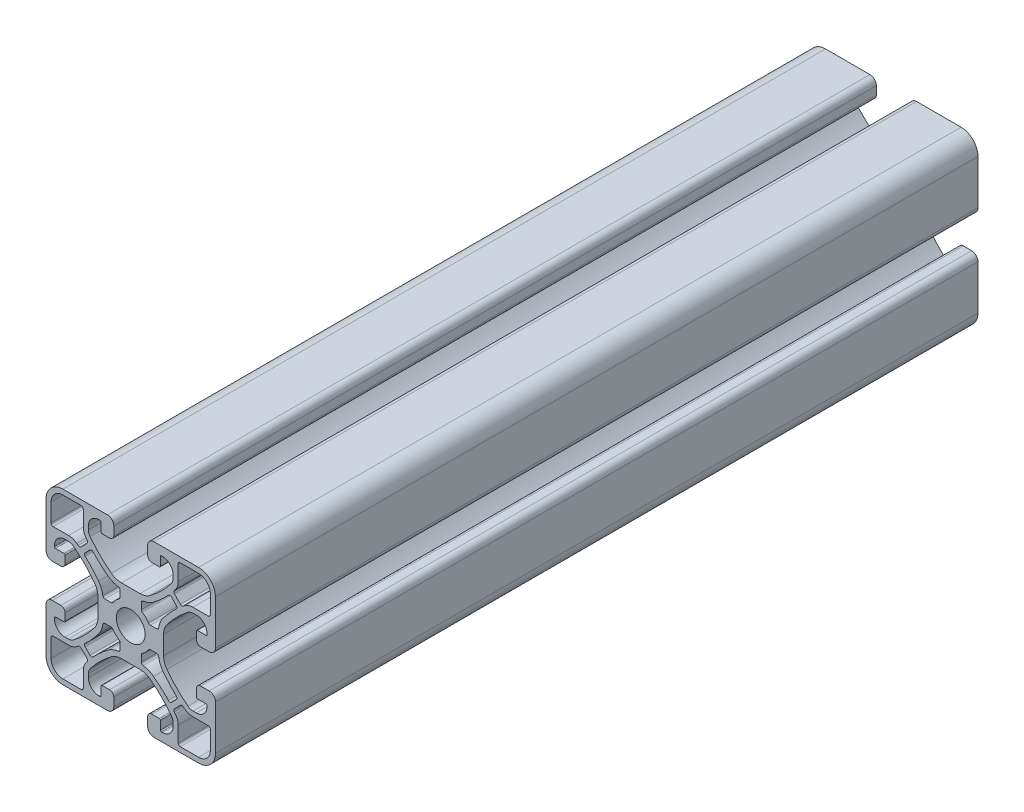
from build123d import *

# Parameters (mm, degrees)
ESQUISSE_PROFIL_R = 3.400000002
EXTRUSION1_DEPTH  = 180


with BuildPart() as part:
    # Esquisse profil → Extrusion1 (new body)
    with BuildSketch(Plane.XY):
        with BuildLine():
            Line((5.500000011, -20), (15.999999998, -20))
            ThreePointArc((15.999999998, -20), (18.82842711, -18.82842713), (20, -16.000000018))
            Line((20, -16.000000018), (20, -5.500000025))
            ThreePointArc((20, -5.500000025), (19.560660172, -4.439339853), (18.5, -4.000000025))
            Line((18.5, -4.000000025), (16.5, -4.000000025))
            ThreePointArc((16.5, -4.000000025), (15.792893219, -4.292893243), (15.5, -5.000000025))
            Line((15.5, -5.000000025), (15.5, -6.750000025))
            ThreePointArc((15.5, -6.750000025), (15.573223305, -6.92677672), (15.75, -7.000000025))
            Line((15.75, -7.000000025), (17.75, -7.000000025))
            ThreePointArc((17.75, -7.000000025), (17.926776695, -7.073223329), (18, -7.250000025))
            Line((18, -7.250000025), (18, -7.500000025))
            ThreePointArc((18, -7.500000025), (17.267766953, -9.267766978), (15.5, -10.000000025))
            Line((15.5, -10.000000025), (14.72036024, -10.000000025))
            ThreePointArc((14.72036024, -10.000000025), (14.083793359, -9.895991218), (13.51343504, -9.594782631))
            ThreePointArc((13.51343504, -9.594782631), (10.848996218, -7.2640298), (8.540476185, -4.580305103))
            ThreePointArc((8.540476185, -4.580305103), (7.952757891, -3.450415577), (7.75, -2.193056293))
            Line((7.75, -2.193056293), (7.75, 2.193056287))
            ThreePointArc((7.75, 2.193056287), (7.952757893, 3.450415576), (8.54047619, 4.580305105))
            ThreePointArc((8.54047619, 4.580305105), (10.848996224, 7.264029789), (13.513435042, 9.594782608))
            ThreePointArc((13.513435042, 9.594782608), (14.083793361, 9.895991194), (14.72036024, 10))
            Line((14.72036024, 10), (15.5, 10))
            ThreePointArc((15.5, 10), (17.267766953, 9.267766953), (18, 7.5))
            Line((18, 7.5), (18, 7.25))
            ThreePointArc((18, 7.25), (17.926776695, 7.073223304), (17.75, 7))
            Line((17.75, 7), (15.75, 7))
            ThreePointArc((15.75, 7), (15.573223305, 6.926776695), (15.5, 6.75))
            Line((15.5, 6.75), (15.5, 5))
            ThreePointArc((15.5, 5), (15.792893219, 4.292893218), (16.5, 4))
            Line((16.5, 4), (18.5, 4))
            ThreePointArc((18.5, 4), (19.560660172, 4.439339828), (20, 5.5))
            Line((20, 5.5), (20, 16.000000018))
            ThreePointArc((20, 16.000000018), (18.828427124, 18.828427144), (15.999999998, 20))
            Line((15.999999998, 20), (5.500000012, 20))
            ThreePointArc((5.500000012, 20), (4.43933984, 19.560660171), (4.000000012, 18.5))
            Line((4.000000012, 18.5), (4.000000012, 16.5))
            ThreePointArc((4.000000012, 16.5), (4.292893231, 15.792893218), (5.000000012, 15.5))
            Line((5.000000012, 15.5), (6.750000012, 15.5))
            ThreePointArc((6.750000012, 15.5), (6.926776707, 15.573223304), (7.000000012, 15.75))
            Line((7.000000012, 15.75), (7.000000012, 17.75))
            ThreePointArc((7.000000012, 17.75), (7.073223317, 17.926776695), (7.250000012, 18))
            Line((7.250000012, 18), (7.500000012, 18))
            ThreePointArc((7.500000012, 18), (9.267766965, 17.267766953), (10.000000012, 15.5))
            Line((10.000000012, 15.5), (10.000000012, 14.72036024))
            ThreePointArc((10.000000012, 14.72036024), (9.895991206, 14.083793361), (9.594782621, 13.513435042))
            ThreePointArc((9.594782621, 13.513435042), (7.264029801, 10.848996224), (4.580305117, 8.540476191))
            ThreePointArc((4.580305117, 8.540476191), (3.450415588, 7.952757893), (2.193056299, 7.75))
            Line((2.193056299, 7.75), (-2.193056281, 7.75))
            ThreePointArc((-2.193056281, 7.75), (-3.45041557, 7.952757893), (-4.580305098, 8.54047619))
            ThreePointArc((-4.580305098, 8.54047619), (-7.264029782, 10.848996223), (-9.594782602, 13.513435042))
            ThreePointArc((-9.594782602, 13.513435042), (-9.895991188, 14.08379336), (-9.999999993, 14.72036024))
            Line((-9.999999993, 14.72036024), (-9.999999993, 15.5))
            ThreePointArc((-9.999999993, 15.5), (-9.267766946, 17.267766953), (-7.499999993, 18))
            Line((-7.499999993, 18), (-7.249999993, 18))
            ThreePointArc((-7.249999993, 18), (-7.073223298, 17.926776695), (-6.999999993, 17.75))
            Line((-6.999999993, 17.75), (-6.999999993, 15.75))
            ThreePointArc((-6.999999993, 15.75), (-6.926776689, 15.573223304), (-6.749999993, 15.5))
            Line((-6.749999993, 15.5), (-4.999999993, 15.5))
            ThreePointArc((-4.999999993, 15.5), (-4.292893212, 15.792893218), (-3.999999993, 16.5))
            Line((-3.999999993, 16.5), (-3.999999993, 18.5))
            ThreePointArc((-3.999999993, 18.5), (-4.439339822, 19.560660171), (-5.499999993, 20))
            Line((-5.499999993, 20), (-15.999999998, 20))
            ThreePointArc((-15.999999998, 20), (-18.82842711, 18.82842713), (-20, 16.000000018))
            Line((-20, 16.000000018), (-20, 5.499999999))
            ThreePointArc((-20, 5.499999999), (-19.560660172, 4.439339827), (-18.5, 3.999999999))
            Line((-18.5, 3.999999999), (-16.5, 3.999999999))
            ThreePointArc((-16.5, 3.999999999), (-15.792893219, 4.292893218), (-15.5, 4.999999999))
            Line((-15.5, 4.999999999), (-15.5, 6.749999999))
            ThreePointArc((-15.5, 6.749999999), (-15.573223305, 6.926776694), (-15.75, 6.999999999))
            Line((-15.75, 6.999999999), (-17.75, 6.999999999))
            ThreePointArc((-17.75, 6.999999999), (-17.926776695, 7.073223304), (-18, 7.249999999))
            Line((-18, 7.249999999), (-18, 7.499999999))
            ThreePointArc((-18, 7.499999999), (-17.267766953, 9.267766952), (-15.5, 9.999999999))
            Line((-15.5, 9.999999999), (-14.72036024, 9.999999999))
            ThreePointArc((-14.72036024, 9.999999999), (-14.083793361, 9.895991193), (-13.513435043, 9.594782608))
            ThreePointArc((-13.513435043, 9.594782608), (-10.848996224, 7.264029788), (-8.540476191, 4.580305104))
            ThreePointArc((-8.540476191, 4.580305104), (-7.952757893, 3.450415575), (-7.75, 2.193056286))
            Line((-7.75, 2.193056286), (-7.75, -2.193056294))
            ThreePointArc((-7.75, -2.193056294), (-7.952757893, -3.450415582), (-8.54047619, -4.580305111))
            ThreePointArc((-8.54047619, -4.580305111), (-10.848996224, -7.264029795), (-13.513435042, -9.594782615))
            ThreePointArc((-13.513435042, -9.594782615), (-14.083793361, -9.8959912), (-14.72036024, -10.000000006))
            Line((-14.72036024, -10.000000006), (-15.5, -10.000000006))
            ThreePointArc((-15.5, -10.000000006), (-17.267766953, -9.267766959), (-18, -7.500000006))
            Line((-18, -7.500000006), (-18, -7.250000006))
            ThreePointArc((-18, -7.250000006), (-17.926776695, -7.073223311), (-17.75, -7.000000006))
            Line((-17.75, -7.000000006), (-15.75, -7.000000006))
            ThreePointArc((-15.75, -7.000000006), (-15.573223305, -6.926776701), (-15.5, -6.750000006))
            Line((-15.5, -6.750000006), (-15.5, -5.000000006))
            ThreePointArc((-15.5, -5.000000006), (-15.792893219, -4.292893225), (-16.5, -4.000000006))
            Line((-16.5, -4.000000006), (-18.5, -4.000000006))
            ThreePointArc((-18.5, -4.000000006), (-19.560660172, -4.439339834), (-20, -5.500000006))
            Line((-20, -5.500000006), (-20, -15.999999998))
            ThreePointArc((-20, -15.999999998), (-18.828427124, -18.828427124), (-15.999999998, -20))
            Line((-15.999999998, -20), (-5.499999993, -20))
            ThreePointArc((-5.499999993, -20), (-4.439339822, -19.560660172), (-3.999999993, -18.5))
            Line((-3.999999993, -18.5), (-3.999999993, -16.5))
            ThreePointArc((-3.999999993, -16.5), (-4.292893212, -15.792893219), (-4.999999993, -15.5))
            Line((-4.999999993, -15.5), (-6.749999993, -15.5))
            ThreePointArc((-6.749999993, -15.5), (-6.926776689, -15.573223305), (-6.999999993, -15.75))
            Line((-6.999999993, -15.75), (-6.999999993, -17.75))
            ThreePointArc((-6.999999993, -17.75), (-7.073223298, -17.926776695), (-7.249999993, -18))
            Line((-7.249999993, -18), (-7.499999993, -18))
            ThreePointArc((-7.499999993, -18), (-9.267766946, -17.267766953), (-9.999999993, -15.5))
            Line((-9.999999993, -15.5), (-9.999999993, -14.72036024))
            ThreePointArc((-9.999999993, -14.72036024), (-9.895991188, -14.083793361), (-9.594782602, -13.513435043))
            ThreePointArc((-9.594782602, -13.513435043), (-7.264029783, -10.848996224), (-4.580305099, -8.540476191))
            ThreePointArc((-4.580305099, -8.540476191), (-3.45041557, -7.952757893), (-2.193056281, -7.75))
            Line((-2.193056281, -7.75), (2.193056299, -7.75))
            ThreePointArc((2.193056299, -7.75), (3.450415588, -7.952757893), (4.580305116, -8.54047619))
            ThreePointArc((4.580305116, -8.54047619), (7.264029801, -10.848996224), (9.59478262, -13.513435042))
            ThreePointArc((9.59478262, -13.513435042), (9.895991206, -14.083793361), (10.000000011, -14.72036024))
            Line((10.000000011, -14.72036024), (10.000000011, -15.5))
            ThreePointArc((10.000000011, -15.5), (9.267766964, -17.267766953), (7.500000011, -18))
            Line((7.500000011, -18), (7.250000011, -18))
            ThreePointArc((7.250000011, -18), (7.073223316, -17.926776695), (7.000000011, -17.75))
            Line((7.000000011, -17.75), (7.000000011, -15.75))
            ThreePointArc((7.000000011, -15.75), (6.926776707, -15.573223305), (6.750000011, -15.5))
            Line((6.750000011, -15.5), (5.000000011, -15.5))
            ThreePointArc((5.000000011, -15.5), (4.29289323, -15.792893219), (4.000000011, -16.5))
            Line((4.000000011, -16.5), (4.000000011, -18.5))
            ThreePointArc((4.000000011, -18.5), (4.43933984, -19.560660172), (5.500000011, -20))
        make_face()
        Circle(ESQUISSE_PROFIL_R, mode=Mode.SUBTRACT)
        with BuildLine():
            Line((11.699666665, 18.8), (15.999999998, 18.8))
            ThreePointArc((15.999999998, 18.8), (17.979898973, 17.979898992), (18.8, 16.000000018))
            Line((18.8, 16.000000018), (18.8, 11.699999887))
            ThreePointArc((18.8, 11.699999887), (18.653553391, 11.346446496), (18.3, 11.199999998))
            Line((18.3, 11.199999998), (14.670026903, 11.199999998))
            ThreePointArc((14.670026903, 11.199999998), (13.651519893, 11.033585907), (12.738946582, 10.551652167))
            Line((12.738946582, 10.551652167), (12.395722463, 10.287411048))
            ThreePointArc((12.395722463, 10.287411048), (12.057202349, 10.181979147), (11.733887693, 10.327510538))
            Line((11.733887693, 10.327510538), (10.327177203, 11.734221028))
            ThreePointArc((10.327177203, 11.734221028), (10.181645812, 12.057535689), (10.287077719, 12.396055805))
            Line((10.287077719, 12.396055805), (10.551318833, 12.739279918))
            ThreePointArc((10.551318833, 12.739279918), (11.033252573, 13.651853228), (11.199666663, 14.670360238))
            Line((11.199666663, 14.670360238), (11.199666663, 18.299999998))
            ThreePointArc((11.199666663, 18.299999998), (11.346113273, 18.65355339), (11.699666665, 18.8))
        make_face(mode=Mode.SUBTRACT)
        with BuildLine():
            Line((-11.199666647, 14.669919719), (-11.199666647, 18.299999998))
            ThreePointArc((-11.199666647, 18.299999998), (-11.346113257, 18.65355339), (-11.699666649, 18.8))
            Line((-11.699666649, 18.8), (-15.999999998, 18.8))
            ThreePointArc((-15.999999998, 18.8), (-17.979898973, 17.979898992), (-18.8, 16.000000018))
            Line((-18.8, 16.000000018), (-18.8, 11.699999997))
            ThreePointArc((-18.8, 11.699999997), (-18.653553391, 11.346446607), (-18.3, 11.199999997))
            Line((-18.3, 11.199999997), (-14.67036024, 11.199999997))
            ThreePointArc((-14.67036024, 11.199999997), (-13.65185323, 11.033585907), (-12.739279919, 10.551652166))
            Line((-12.739279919, 10.551652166), (-12.3960558, 10.287411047))
            ThreePointArc((-12.3960558, 10.287411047), (-12.057535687, 10.181979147), (-11.73422103, 10.327510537))
            Line((-11.73422103, 10.327510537), (-10.32751054, 11.734221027))
            ThreePointArc((-10.32751054, 11.734221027), (-10.181979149, 12.057535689), (-10.287411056, 12.396055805))
            Line((-10.287411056, 12.396055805), (-10.551651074, 12.739278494))
            ThreePointArc((-10.551651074, 12.739278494), (-11.033340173, 13.651673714), (-11.199666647, 14.669919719))
        make_face(mode=Mode.SUBTRACT)
        with BuildLine():
            Line((-2.500000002, 6.098239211), (-2.500000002, 4.609772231))
            ThreePointArc((-2.500000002, 4.609772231), (-2.560475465, 4.371406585), (-2.727272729, 4.19070203))
            ThreePointArc((-2.727272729, 4.19070203), (-3.535533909, 3.535533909), (-4.19070203, 2.727272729))
            ThreePointArc((-4.19070203, 2.727272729), (-4.371406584, 2.560475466), (-4.609772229, 2.500000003))
            Line((-4.609772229, 2.500000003), (-6.098239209, 2.500000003))
            ThreePointArc((-6.098239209, 2.500000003), (-6.428045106, 2.62419677), (-6.594007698, 2.935087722))
            ThreePointArc((-6.594007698, 2.935087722), (-6.934262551, 4.221803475), (-7.589999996, 5.380000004))
            ThreePointArc((-7.589999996, 5.380000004), (-9.089852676, 7.202595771), (-10.747651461, 8.882809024))
            ThreePointArc((-10.747651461, 8.882809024), (-10.907820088, 9.24007063), (-10.761465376, 9.603209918))
            Line((-10.761465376, 9.603209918), (-9.603209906, 10.761465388))
            ThreePointArc((-9.603209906, 10.761465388), (-9.240070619, 10.907820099), (-8.882809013, 10.747651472))
            ThreePointArc((-8.882809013, 10.747651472), (-7.202595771, 9.089852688), (-5.380000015, 7.590000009))
            ThreePointArc((-5.380000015, 7.590000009), (-4.221803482, 6.934262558), (-2.935087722, 6.594007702))
            ThreePointArc((-2.935087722, 6.594007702), (-2.624196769, 6.428045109), (-2.500000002, 6.098239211))
        make_face(mode=Mode.SUBTRACT)
        with BuildLine():
            Line((-10.761465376, -9.603209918), (-9.603209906, -10.761465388))
            ThreePointArc((-9.603209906, -10.761465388), (-9.240070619, -10.907820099), (-8.882809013, -10.747651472))
            ThreePointArc((-8.882809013, -10.747651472), (-7.202595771, -9.089852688), (-5.380000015, -7.590000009))
            ThreePointArc((-5.380000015, -7.590000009), (-4.221803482, -6.934262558), (-2.935087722, -6.594007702))
            ThreePointArc((-2.935087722, -6.594007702), (-2.624196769, -6.428045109), (-2.500000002, -6.098239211))
            Line((-2.500000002, -6.098239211), (-2.500000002, -4.609772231))
            ThreePointArc((-2.500000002, -4.609772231), (-2.560475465, -4.371406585), (-2.727272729, -4.19070203))
            ThreePointArc((-2.727272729, -4.19070203), (-3.535533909, -3.535533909), (-4.19070203, -2.727272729))
            ThreePointArc((-4.19070203, -2.727272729), (-4.371406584, -2.560475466), (-4.609772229, -2.500000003))
            Line((-4.609772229, -2.500000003), (-6.098239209, -2.500000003))
            ThreePointArc((-6.098239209, -2.500000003), (-6.428045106, -2.62419677), (-6.594007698, -2.935087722))
            ThreePointArc((-6.594007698, -2.935087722), (-6.934262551, -4.221803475), (-7.589999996, -5.380000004))
            ThreePointArc((-7.589999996, -5.380000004), (-9.089852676, -7.202595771), (-10.747651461, -8.882809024))
            ThreePointArc((-10.747651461, -8.882809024), (-10.907820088, -9.24007063), (-10.761465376, -9.603209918))
        make_face(mode=Mode.SUBTRACT)
        with BuildLine():
            Line((-11.699999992, -18.8), (-15.999999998, -18.8))
            ThreePointArc((-15.999999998, -18.8), (-17.979898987, -17.979898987), (-18.8, -15.999999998))
            Line((-18.8, -15.999999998), (-18.8, -11.700000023))
            ThreePointArc((-18.8, -11.700000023), (-18.653553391, -11.346446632), (-18.3, -11.200000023))
            Line((-18.3, -11.200000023), (-14.67036024, -11.200000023))
            ThreePointArc((-14.67036024, -11.200000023), (-13.65185323, -11.033585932), (-12.739279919, -10.551652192))
            Line((-12.739279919, -10.551652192), (-12.3960558, -10.287411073))
            ThreePointArc((-12.3960558, -10.287411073), (-12.057535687, -10.181979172), (-11.73422103, -10.327510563))
            Line((-11.73422103, -10.327510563), (-10.32751054, -11.734221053))
            ThreePointArc((-10.32751054, -11.734221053), (-10.181979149, -12.057535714), (-10.287411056, -12.39605583))
            Line((-10.287411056, -12.39605583), (-10.55165217, -12.739279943))
            ThreePointArc((-10.55165217, -12.739279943), (-11.033585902, -13.651853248), (-11.19999999, -14.670360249))
            Line((-11.19999999, -14.670360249), (-11.19999999, -18.299999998))
            ThreePointArc((-11.19999999, -18.299999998), (-11.3464466, -18.65355339), (-11.699999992, -18.8))
        make_face(mode=Mode.SUBTRACT)
        with BuildLine():
            Line((9.603209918, 10.761465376), (10.761465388, 9.603209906))
            ThreePointArc((10.761465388, 9.603209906), (10.907820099, 9.240070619), (10.747651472, 8.882809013))
            ThreePointArc((10.747651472, 8.882809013), (9.089852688, 7.202595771), (7.590000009, 5.380000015))
            ThreePointArc((7.590000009, 5.380000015), (6.934262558, 4.221803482), (6.594007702, 2.935087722))
            ThreePointArc((6.594007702, 2.935087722), (6.428045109, 2.624196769), (6.098239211, 2.500000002))
            Line((6.098239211, 2.500000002), (4.609772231, 2.500000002))
            ThreePointArc((4.609772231, 2.500000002), (4.371406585, 2.560475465), (4.19070203, 2.727272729))
            ThreePointArc((4.19070203, 2.727272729), (3.535533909, 3.535533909), (2.727272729, 4.19070203))
            ThreePointArc((2.727272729, 4.19070203), (2.560475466, 4.371406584), (2.500000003, 4.609772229))
            Line((2.500000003, 4.609772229), (2.500000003, 6.098239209))
            ThreePointArc((2.500000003, 6.098239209), (2.62419677, 6.428045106), (2.935087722, 6.594007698))
            ThreePointArc((2.935087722, 6.594007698), (4.221803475, 6.934262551), (5.380000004, 7.589999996))
            ThreePointArc((5.380000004, 7.589999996), (7.202595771, 9.089852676), (8.882809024, 10.747651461))
            ThreePointArc((8.882809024, 10.747651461), (9.24007063, 10.907820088), (9.603209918, 10.761465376))
        make_face(mode=Mode.SUBTRACT)
        with BuildLine():
            Line((2.500000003, -4.609772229), (2.500000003, -6.098239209))
            ThreePointArc((2.500000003, -6.098239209), (2.62419677, -6.428045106), (2.935087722, -6.594007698))
            ThreePointArc((2.935087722, -6.594007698), (4.221803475, -6.934262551), (5.380000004, -7.589999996))
            ThreePointArc((5.380000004, -7.589999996), (7.202595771, -9.089852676), (8.882809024, -10.747651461))
            ThreePointArc((8.882809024, -10.747651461), (9.24007063, -10.907820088), (9.603209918, -10.761465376))
            Line((9.603209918, -10.761465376), (10.761465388, -9.603209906))
            ThreePointArc((10.761465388, -9.603209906), (10.907820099, -9.240070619), (10.747651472, -8.882809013))
            ThreePointArc((10.747651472, -8.882809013), (9.089852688, -7.202595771), (7.590000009, -5.380000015))
            ThreePointArc((7.590000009, -5.380000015), (6.934262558, -4.221803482), (6.594007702, -2.935087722))
            ThreePointArc((6.594007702, -2.935087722), (6.428045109, -2.624196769), (6.098239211, -2.500000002))
            Line((6.098239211, -2.500000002), (4.609772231, -2.500000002))
            ThreePointArc((4.609772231, -2.500000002), (4.371406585, -2.560475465), (4.19070203, -2.727272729))
            ThreePointArc((4.19070203, -2.727272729), (3.535533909, -3.535533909), (2.727272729, -4.19070203))
            ThreePointArc((2.727272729, -4.19070203), (2.560475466, -4.371406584), (2.500000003, -4.609772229))
        make_face(mode=Mode.SUBTRACT)
        with BuildLine():
            Line((11.199666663, -14.670360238), (11.199666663, -18.299999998))
            ThreePointArc((11.199666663, -18.299999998), (11.346113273, -18.65355339), (11.699666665, -18.8))
            Line((11.699666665, -18.8), (15.999999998, -18.8))
            ThreePointArc((15.999999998, -18.8), (17.979898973, -17.979898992), (18.8, -16.000000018))
            Line((18.8, -16.000000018), (18.8, -11.699999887))
            ThreePointArc((18.8, -11.699999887), (18.653553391, -11.346446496), (18.3, -11.199999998))
            Line((18.3, -11.199999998), (14.670026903, -11.199999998))
            ThreePointArc((14.670026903, -11.199999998), (13.651519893, -11.033585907), (12.738946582, -10.551652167))
            Line((12.738946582, -10.551652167), (12.395722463, -10.287411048))
            ThreePointArc((12.395722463, -10.287411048), (12.057202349, -10.181979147), (11.733887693, -10.327510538))
            Line((11.733887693, -10.327510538), (10.327177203, -11.734221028))
            ThreePointArc((10.327177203, -11.734221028), (10.181645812, -12.057535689), (10.287077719, -12.396055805))
            Line((10.287077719, -12.396055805), (10.551318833, -12.739279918))
            ThreePointArc((10.551318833, -12.739279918), (11.033252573, -13.651853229), (11.199666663, -14.670360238))
        make_face(mode=Mode.SUBTRACT)
    extrude(amount=EXTRUSION1_DEPTH)


solid = part.part
